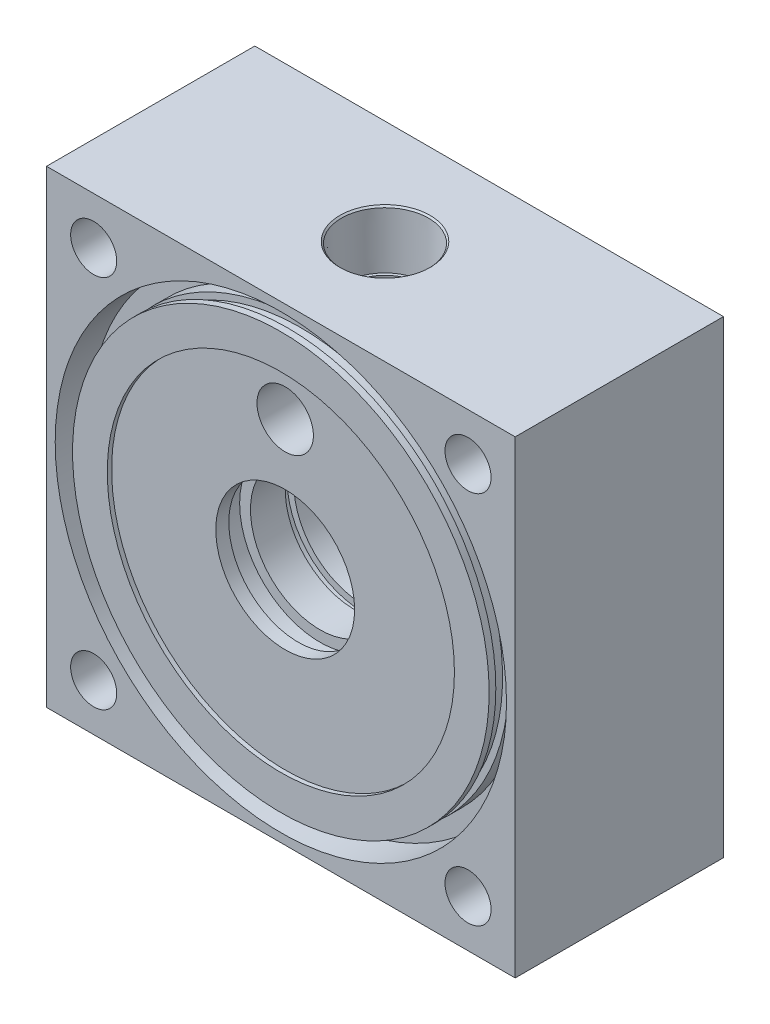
from build123d import *

# Parameters (mm, degrees)
SKETCH1_W                    = 85.725
SKETCH1_H                    = 85.725
EXTRUDE1_DEPTH               = 38.1
SKETCH2_R                    = 41.275
SKETCH2_R_2                  = 38.1
CUT_EXTRUDE1_DEPTH           = 6.35
SKETCH9_R                    = 31.75
CUT_EXTRUDE3_DEPTH           = 0.79375
SKETCH10_R                   = 12.7
CUT_EXTRUDE4_DEPTH           = 72.596074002
SKETCH13_W                   = 2.38125
SKETCH13_H                   = 1.143
SKETCH14_W                   = 3.96875
SKETCH14_H                   = 1.984375
SKETCH14_W_2                 = 1.5875
SKETCH14_H_2                 = 1.2192
SKETCH15_R                   = 14.684375
EXTRUDE2_DEPTH               = 19.05
F_1_3_8_6_TAPPED_HOLE3_D     = 30.95752
F_1_3_8_6_TAPPED_HOLE3_DEPTH = 15.875
F_1_3_8_6_TAPPED_HOLE3_TIP   = 9.300577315
F_5_16_CLEARANCE_HOLE1_D     = 8.4328
F_3_8_16_TAPPED_HOLE1_D      = 7.9375
F_3_8_16_TAPPED_HOLE1_DEPTH  = 27.0002
F_3_8_16_TAPPED_HOLE1_TIP    = 2.384665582


with BuildPart() as part:
    # Sketch1 → Extrude1 (new body)
    with BuildSketch(Plane.XY):
        Rectangle(SKETCH1_W, SKETCH1_H)
    extrude(amount=EXTRUDE1_DEPTH)

    # Sketch2 → Cut-Extrude1 (cut)
    with BuildSketch(Plane.XY.offset(38.1)):
        Circle(SKETCH2_R)
        Circle(SKETCH2_R_2, mode=Mode.SUBTRACT)
    extrude(amount=-CUT_EXTRUDE1_DEPTH, mode=Mode.SUBTRACT)

    # Sketch4 → 3_8 NPT Tapped Hole1 (revolve, cut)
    with BuildSketch(Plane(origin=(0, 42.8625, 19.05), x_dir=(0, 0, 1), z_dir=(1, 0, 0))):
        Polygon((0, 0), (0, 23.338582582), (7.1374, 19.05), (7.1374, 10.414), (7.662399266, 10.414), (7.9655416, 0.2894584), (8.255, 0), align=None)
    revolve(axis=Axis((0, 49.2125, 19.05), (0, -1, 0)), mode=Mode.SUBTRACT)

    # Sketch9 → Cut-Extrude3 (cut)
    with BuildSketch(Plane.XY.offset(38.1)):
        Circle(SKETCH9_R)
    extrude(amount=-CUT_EXTRUDE3_DEPTH, mode=Mode.SUBTRACT)

    # Sketch10 → Cut-Extrude4 (cut, through all)
    with BuildSketch(Plane.XY.offset(38.1)):
        Circle(SKETCH10_R)
    extrude(amount=-CUT_EXTRUDE4_DEPTH, mode=Mode.SUBTRACT)

    # Sketch12 → Cut-Revolve1 (revolve, cut)
    with BuildSketch(Plane.ZY, mode=Mode.PRIVATE) as cut_revolve1_sk:
        Polygon((38.1, 23.8125), (38.1, 18.6531758), (9.525, 18.6531758), (9.525, 20.6375), (0, 20.6375), (0, 23.8125), align=None)
    revolve(cut_revolve1_sk.sketch.rotate(Axis((0, 23.8125, 38.1), (0, 0, 1)), 270), axis=Axis((0, 23.8125, 38.1), (0, 0, 1)), mode=Mode.SUBTRACT)

    # Sketch13 → Cut-Revolve2 (revolve, cut)
    with BuildSketch(Plane(origin=(0, 0, 0), x_dir=(0, 0, -1), z_dir=(1, 0, 0)), mode=Mode.PRIVATE) as cut_revolve2_sk:
        with Locations((-35.690175, 37.5285)):
            Rectangle(SKETCH13_W, SKETCH13_H)
    revolve(cut_revolve2_sk.sketch.rotate(Axis((0, 0, 0), (0, 0, 1)), 270), axis=Axis((0, 0, 0), (0, 0, 1)), mode=Mode.SUBTRACT)

    # Sketch14 → Cut-Revolve3 (revolve, cut)
    with BuildSketch(Plane(origin=(0, 0, 0), x_dir=(0, 0, -1), z_dir=(1, 0, 0)), mode=Mode.PRIVATE) as cut_revolve3_sk:
        with Locations((-32.940625, 13.6921875)):
            Rectangle(SKETCH14_W, SKETCH14_H)
        with Locations((-23.8125, 13.3096)):
            Rectangle(SKETCH14_W_2, SKETCH14_H_2)
    revolve(cut_revolve3_sk.sketch.rotate(Axis((0, 0, 0), (0, 0, 1)), 270), axis=Axis((0, 0, 0), (0, 0, 1)), mode=Mode.SUBTRACT)

    # Sketch15 → Extrude2 (cut)
    with BuildSketch(Plane(origin=(0, 0, 0), x_dir=(-1, 0, 0), z_dir=(0, 0, -1))):
        Circle(SKETCH15_R)
    extrude(amount=-EXTRUDE2_DEPTH, mode=Mode.SUBTRACT)

    # 1-3_8-6 Tapped Hole3
    with Locations(Plane(origin=(0, 0, 0), x_dir=(-1, 0, 0), z_dir=(0, 0, -1))):
        with Locations((0, 0)):
            Hole(F_1_3_8_6_TAPPED_HOLE3_D / 2, depth=F_1_3_8_6_TAPPED_HOLE3_DEPTH)
            with Locations((0, 0, -(F_1_3_8_6_TAPPED_HOLE3_DEPTH + F_1_3_8_6_TAPPED_HOLE3_TIP / 2))):  # 118° drill point
                Cone(0, F_1_3_8_6_TAPPED_HOLE3_D / 2, F_1_3_8_6_TAPPED_HOLE3_TIP, mode=Mode.SUBTRACT)

    # 5_16 Clearance Hole1 (through all)
    with Locations(Plane.XY.offset(38.1)):
        with Locations((-34.237226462, 34.237226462), (-34.237226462, -34.237226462), (34.237226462, -34.237226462), (34.237226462, 34.237226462)):
            Hole(F_5_16_CLEARANCE_HOLE1_D / 2)

    # 3_8-16 Tapped Hole1
    with Locations(Plane.ZY.offset(42.8625)):
        with Locations((19.05, -22.225), (19.05, 22.225)):
            Hole(F_3_8_16_TAPPED_HOLE1_D / 2, depth=F_3_8_16_TAPPED_HOLE1_DEPTH)
            with Locations((0, 0, -(F_3_8_16_TAPPED_HOLE1_DEPTH + F_3_8_16_TAPPED_HOLE1_TIP / 2))):  # 118° drill point
                Cone(0, F_3_8_16_TAPPED_HOLE1_D / 2, F_3_8_16_TAPPED_HOLE1_TIP, mode=Mode.SUBTRACT)


solid = part.part
